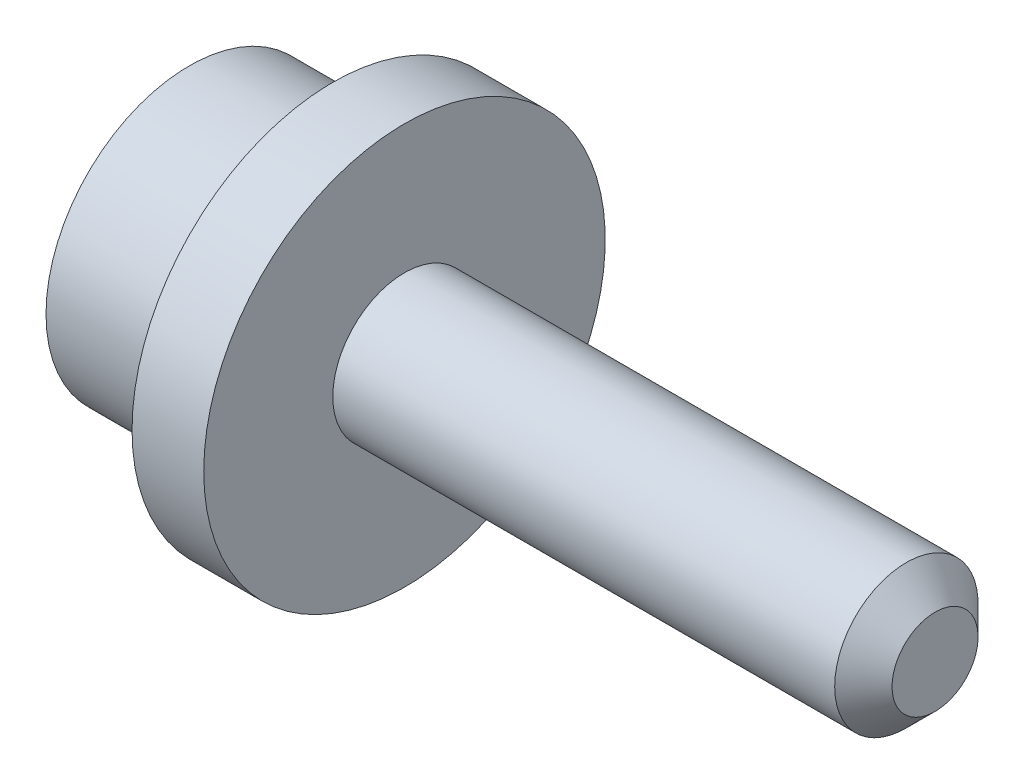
from build123d import *

# Parameters (mm, degrees)
CHANFREIN1_SIZE = 1


with BuildPart() as part:
    # Esquisse1 → R_volution1 (revolve)
    with BuildSketch(Plane.XY, mode=Mode.PRIVATE) as r_volution1_sk:
        Polygon((0, 1.5), (15, 1.5), (15, 0), (26, 0), (26, 2.5), (7.5, 2.5), (7.5, 7), (5, 7), (5, 5), (0, 5), align=None)
    revolve(r_volution1_sk.sketch.rotate(Axis((-19.163170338, 0, 0), (1, 0, 0)), 90), axis=Axis((-19.163170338, 0, 0), (1, 0, 0)))

    # Chanfrein1
    chanfrein1_edges = [part.edges().sort_by_distance(p)[0] for p in [
        (26, 0, -2.5),
    ]]
    chamfer(chanfrein1_edges, length=CHANFREIN1_SIZE)


solid = part.part
